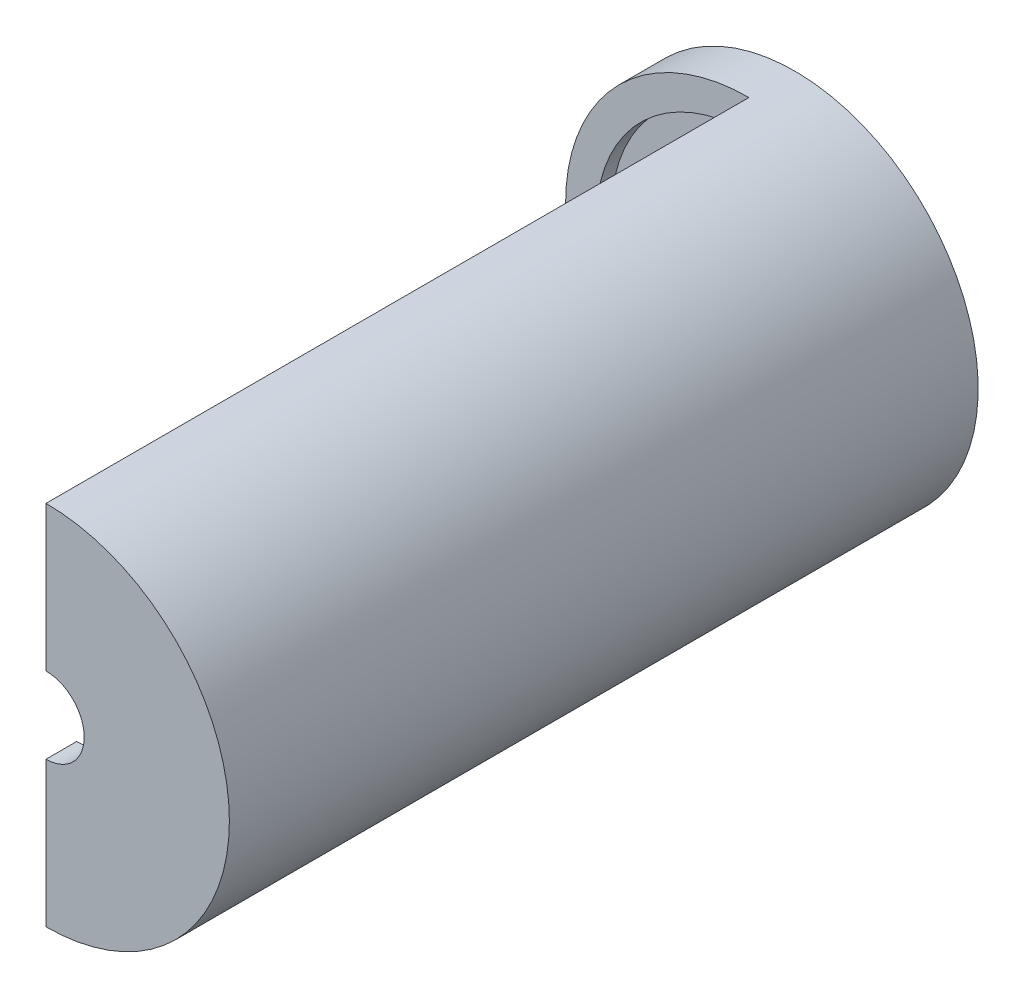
from build123d import *

# Parameters (mm, degrees)
ESQUISSE1_R             = 12
ESQUISSE1_R_2           = 10
EXTRU_MINCE1_DEPTH      = 45
BOSS_EXTRU_1_START      = 2
ESQUISSE2_R             = 12
BOSS_EXTRU_1_DEPTH      = 2
ESQUISSE3_R             = 12
ESQUISSE3_R_2           = 2.5
BOSS_EXTRU_2_DEPTH      = 2
ESQUISSE4_W             = 52.317658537
ESQUISSE4_H             = 39.336585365
ENL_V_MAT_EXTRU_1_DEPTH = 50.969990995


with BuildPart() as part:
    # Esquisse1 → Extru.-Mince1 (new body)
    with BuildSketch(Plane.XY):
        Circle(ESQUISSE1_R)
        Circle(ESQUISSE1_R_2, mode=Mode.SUBTRACT)
    extrude(amount=EXTRU_MINCE1_DEPTH)

    # Esquisse2 → Boss.-Extru.1 (add)
    with BuildSketch(Plane(origin=(0, 0, 0), x_dir=(-1, 0, 0), z_dir=(0, 0, -1)).offset(BOSS_EXTRU_1_START)):
        Circle(ESQUISSE2_R)
    extrude(amount=-BOSS_EXTRU_1_DEPTH)

    # Esquisse3 → Boss.-Extru.2 (add)
    with BuildSketch(Plane.XY.offset(45)):
        with Locations(Location((0, 0, 0), (0, 0, 180))):
            Circle(ESQUISSE3_R)
        Circle(ESQUISSE3_R_2, mode=Mode.SUBTRACT)
    extrude(amount=BOSS_EXTRU_2_DEPTH)

    # Esquisse4 → Enl_v. mat.-Extru.1 (cut, through all)
    with BuildSketch(Plane(origin=(0, 0, 0), x_dir=(0, 0, -1), z_dir=(1, 0, 0))):
        with Locations((-27.158829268, -1.770146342)):
            Rectangle(ESQUISSE4_W, ESQUISSE4_H)
    extrude(amount=-ENL_V_MAT_EXTRU_1_DEPTH, mode=Mode.SUBTRACT)


solid = part.part
